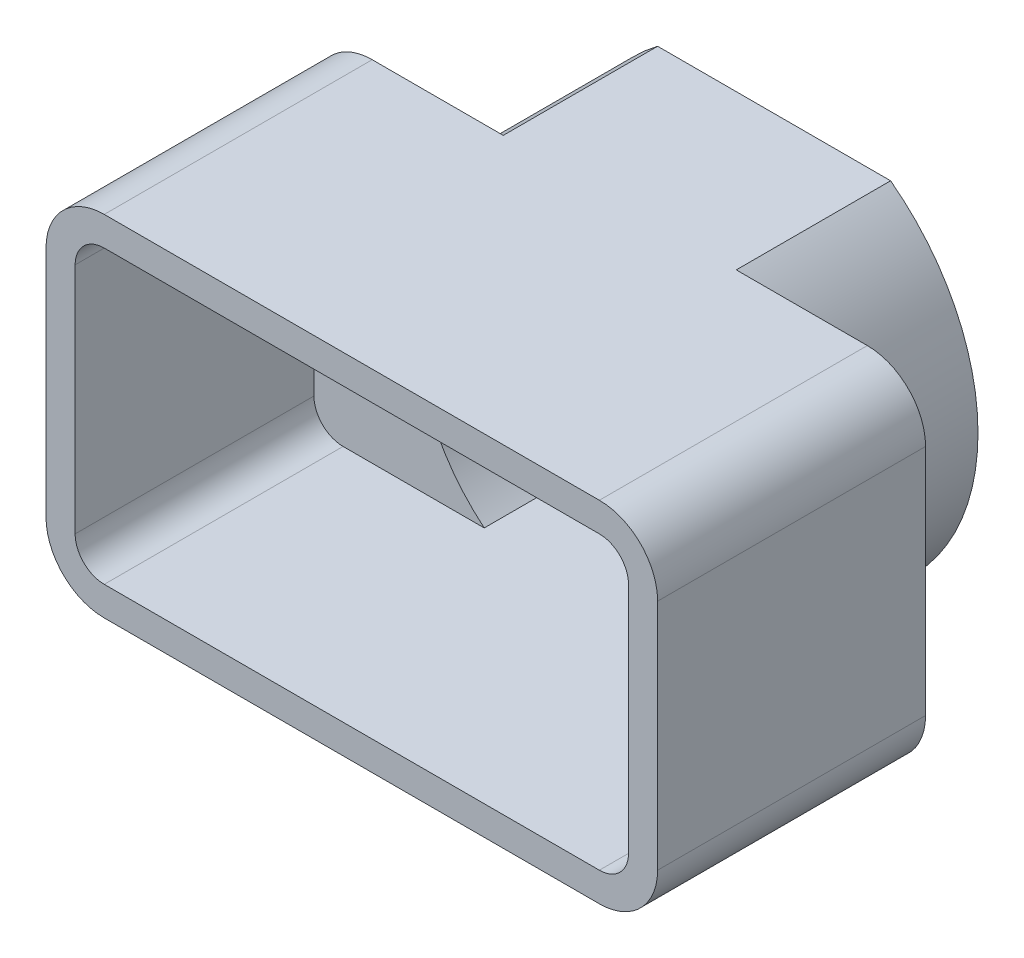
ISO-10303-21;
HEADER;
FILE_DESCRIPTION(('STEP AP214'),'2;1');
FILE_NAME('part.step','',(''),(''),'','','');
FILE_SCHEMA(('AUTOMOTIVE_DESIGN { 1 0 10303 214 1 1 1 1 }'));
ENDSEC;
DATA;
#1=APPLICATION_CONTEXT('core data for automotive mechanical design processes');
#2=APPLICATION_PROTOCOL_DEFINITION('international standard','automotive_design',2000,#1);
#3=PRODUCT_CONTEXT('',#1,'mechanical');
#4=PRODUCT('Part','Part','',(#3));
#5=PRODUCT_RELATED_PRODUCT_CATEGORY('part','',(#4));
#6=PRODUCT_DEFINITION_FORMATION('','',#4);
#7=PRODUCT_DEFINITION_CONTEXT('part definition',#1,'design');
#8=PRODUCT_DEFINITION('design','',#6,#7);
#9=PRODUCT_DEFINITION_SHAPE('','',#8);
#10=(LENGTH_UNIT() NAMED_UNIT(*) SI_UNIT(.MILLI.,.METRE.));
#11=(NAMED_UNIT(*) PLANE_ANGLE_UNIT() SI_UNIT($,.RADIAN.));
#12=(NAMED_UNIT(*) SI_UNIT($,.STERADIAN.) SOLID_ANGLE_UNIT());
#13=UNCERTAINTY_MEASURE_WITH_UNIT(LENGTH_MEASURE(1.E-05),#10,'distance_accuracy_value','');
#14=(GEOMETRIC_REPRESENTATION_CONTEXT(3) GLOBAL_UNCERTAINTY_ASSIGNED_CONTEXT((#13)) GLOBAL_UNIT_ASSIGNED_CONTEXT((#10,
#11,#12)) REPRESENTATION_CONTEXT('',''));
#15=CARTESIAN_POINT('',(0.,0.,0.));
#16=DIRECTION('',(0.,0.,1.));
#17=DIRECTION('',(1.,0.,0.));
#18=AXIS2_PLACEMENT_3D('',#15,#16,#17);
#19=CARTESIAN_POINT('',(-0.5,0.,5.3));
#20=DIRECTION('',(0.,0.,-1.));
#21=DIRECTION('',(-1.,0.,0.));
#22=AXIS2_PLACEMENT_3D('',#19,#20,#21);
#23=CYLINDRICAL_SURFACE('',#22,6.5);
#24=DIRECTION('',(0.,0.,-1.));
#25=VECTOR('',#24,1.);
#26=CARTESIAN_POINT('',(3.65331193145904,5.,5.3));
#27=LINE('',#26,#25);
#28=CARTESIAN_POINT('',(3.65331193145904,5.,6.3));
#29=VERTEX_POINT('',#28);
#30=CARTESIAN_POINT('',(3.65331193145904,5.,1.));
#31=VERTEX_POINT('',#30);
#32=EDGE_CURVE('E204',#29,#31,#27,.T.);
#33=ORIENTED_EDGE('',*,*,#32,.T.);
#34=CARTESIAN_POINT('',(-0.5,0.,1.));
#35=DIRECTION('',(0.,0.,-1.));
#36=DIRECTION('',(-1.,0.,0.));
#37=AXIS2_PLACEMENT_3D('',#34,#35,#36);
#38=CIRCLE('',#37,6.5);
#39=CARTESIAN_POINT('',(3.65331193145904,-5.,1.));
#40=VERTEX_POINT('',#39);
#41=EDGE_CURVE('E192',#31,#40,#38,.T.);
#42=ORIENTED_EDGE('',*,*,#41,.T.);
#43=DIRECTION('',(0.,0.,-1.));
#44=VECTOR('',#43,1.);
#45=CARTESIAN_POINT('',(3.65331193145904,-5.,5.3));
#46=LINE('',#45,#44);
#47=CARTESIAN_POINT('',(3.65331193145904,-5.,6.3));
#48=VERTEX_POINT('',#47);
#49=EDGE_CURVE('E202',#48,#40,#46,.T.);
#50=ORIENTED_EDGE('',*,*,#49,.F.);
#51=CARTESIAN_POINT('',(-0.5,0.,6.3));
#52=DIRECTION('',(0.,0.,-1.));
#53=DIRECTION('',(-1.,0.,0.));
#54=AXIS2_PLACEMENT_3D('',#51,#52,#53);
#55=CIRCLE('',#54,6.5);
#56=EDGE_CURVE('E377',#29,#48,#55,.T.);
#57=ORIENTED_EDGE('',*,*,#56,.F.);
#58=EDGE_LOOP('',(#33,#42,#50,#57));
#59=FACE_BOUND('',#58,.T.);
#60=ADVANCED_FACE('F31',(#59),#23,.F.);
#61=CARTESIAN_POINT('',(3.65331193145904,5.,5.3));
#62=DIRECTION('',(0.,-1.,0.));
#63=DIRECTION('',(0.,0.,-1.));
#64=AXIS2_PLACEMENT_3D('',#61,#62,#63);
#65=PLANE('',#64);
#66=DIRECTION('',(0.,0.,-1.));
#67=VECTOR('',#66,1.);
#68=CARTESIAN_POINT('',(-3.65331193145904,5.,5.3));
#69=LINE('',#68,#67);
#70=CARTESIAN_POINT('',(-3.65331193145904,5.,6.3));
#71=VERTEX_POINT('',#70);
#72=CARTESIAN_POINT('',(-3.65331193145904,5.,1.));
#73=VERTEX_POINT('',#72);
#74=EDGE_CURVE('E215',#71,#73,#69,.T.);
#75=ORIENTED_EDGE('',*,*,#74,.T.);
#76=DIRECTION('',(1.,0.,0.));
#77=VECTOR('',#76,1.);
#78=CARTESIAN_POINT('',(3.65331193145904,5.,1.));
#79=LINE('',#78,#77);
#80=EDGE_CURVE('E206',#73,#31,#79,.T.);
#81=ORIENTED_EDGE('',*,*,#80,.T.);
#82=ORIENTED_EDGE('',*,*,#32,.F.);
#83=DIRECTION('',(-1.,0.,0.));
#84=VECTOR('',#83,1.);
#85=CARTESIAN_POINT('',(-8.49999999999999,5.,6.3));
#86=LINE('',#85,#84);
#87=CARTESIAN_POINT('',(8.49999999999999,5.,6.3));
#88=VERTEX_POINT('',#87);
#89=EDGE_CURVE('E656',#88,#29,#86,.T.);
#90=ORIENTED_EDGE('',*,*,#89,.F.);
#91=DIRECTION('',(0.,0.,1.));
#92=VECTOR('',#91,1.);
#93=CARTESIAN_POINT('',(8.49999999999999,5.,6.3));
#94=LINE('',#93,#92);
#95=CARTESIAN_POINT('',(8.49999999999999,5.,14.5));
#96=VERTEX_POINT('',#95);
#97=EDGE_CURVE('E675',#88,#96,#94,.T.);
#98=ORIENTED_EDGE('',*,*,#97,.T.);
#99=DIRECTION('',(-1.,0.,0.));
#100=VECTOR('',#99,1.);
#101=CARTESIAN_POINT('',(-3.65331193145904,5.,14.5));
#102=LINE('',#101,#100);
#103=CARTESIAN_POINT('',(-8.49999999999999,5.,14.5));
#104=VERTEX_POINT('',#103);
#105=EDGE_CURVE('E53',#96,#104,#102,.T.);
#106=ORIENTED_EDGE('',*,*,#105,.T.);
#107=DIRECTION('',(0.,0.,1.));
#108=VECTOR('',#107,1.);
#109=CARTESIAN_POINT('',(-8.49999999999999,5.,6.3));
#110=LINE('',#109,#108);
#111=CARTESIAN_POINT('',(-8.49999999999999,5.,6.3));
#112=VERTEX_POINT('',#111);
#113=EDGE_CURVE('E706',#112,#104,#110,.T.);
#114=ORIENTED_EDGE('',*,*,#113,.F.);
#115=EDGE_CURVE('E654',#71,#112,#86,.T.);
#116=ORIENTED_EDGE('',*,*,#115,.F.);
#117=EDGE_LOOP('',(#75,#81,#82,#90,#98,#106,#114,#116));
#118=FACE_BOUND('',#117,.T.);
#119=ADVANCED_FACE('F398',(#118),#65,.T.);
#120=CARTESIAN_POINT('',(0.5,0.,5.3));
#121=DIRECTION('',(0.,0.,-1.));
#122=DIRECTION('',(-1.,0.,0.));
#123=AXIS2_PLACEMENT_3D('',#120,#121,#122);
#124=CYLINDRICAL_SURFACE('',#123,6.5);
#125=DIRECTION('',(0.,0.,-1.));
#126=VECTOR('',#125,1.);
#127=CARTESIAN_POINT('',(-3.65331193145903,-5.,5.3));
#128=LINE('',#127,#126);
#129=CARTESIAN_POINT('',(-3.65331193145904,-5.,6.3));
#130=VERTEX_POINT('',#129);
#131=CARTESIAN_POINT('',(-3.65331193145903,-5.,1.));
#132=VERTEX_POINT('',#131);
#133=EDGE_CURVE('E212',#130,#132,#128,.T.);
#134=ORIENTED_EDGE('',*,*,#133,.T.);
#135=CARTESIAN_POINT('',(0.5,0.,1.));
#136=DIRECTION('',(0.,0.,-1.));
#137=DIRECTION('',(-1.,0.,0.));
#138=AXIS2_PLACEMENT_3D('',#135,#136,#137);
#139=CIRCLE('',#138,6.5);
#140=EDGE_CURVE('E46',#132,#73,#139,.T.);
#141=ORIENTED_EDGE('',*,*,#140,.T.);
#142=ORIENTED_EDGE('',*,*,#74,.F.);
#143=CARTESIAN_POINT('',(0.5,0.,6.3));
#144=DIRECTION('',(0.,0.,-1.));
#145=DIRECTION('',(-1.,0.,0.));
#146=AXIS2_PLACEMENT_3D('',#143,#144,#145);
#147=CIRCLE('',#146,6.5);
#148=EDGE_CURVE('E693',#130,#71,#147,.T.);
#149=ORIENTED_EDGE('',*,*,#148,.F.);
#150=EDGE_LOOP('',(#134,#141,#142,#149));
#151=FACE_BOUND('',#150,.T.);
#152=ADVANCED_FACE('F403',(#151),#124,.F.);
#153=CARTESIAN_POINT('',(3.65331193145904,-5.,5.3));
#154=DIRECTION('',(0.,1.,0.));
#155=DIRECTION('',(0.,0.,1.));
#156=AXIS2_PLACEMENT_3D('',#153,#154,#155);
#157=PLANE('',#156);
#158=ORIENTED_EDGE('',*,*,#49,.T.);
#159=DIRECTION('',(-1.,0.,0.));
#160=VECTOR('',#159,1.);
#161=CARTESIAN_POINT('',(3.65331193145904,-5.,1.));
#162=LINE('',#161,#160);
#163=EDGE_CURVE('E11',#40,#132,#162,.T.);
#164=ORIENTED_EDGE('',*,*,#163,.T.);
#165=ORIENTED_EDGE('',*,*,#133,.F.);
#166=DIRECTION('',(1.,0.,0.));
#167=VECTOR('',#166,1.);
#168=CARTESIAN_POINT('',(-8.49999999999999,-5.,6.3));
#169=LINE('',#168,#167);
#170=CARTESIAN_POINT('',(-8.49999999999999,-5.,6.3));
#171=VERTEX_POINT('',#170);
#172=EDGE_CURVE('E667',#171,#130,#169,.T.);
#173=ORIENTED_EDGE('',*,*,#172,.F.);
#174=DIRECTION('',(0.,0.,1.));
#175=VECTOR('',#174,1.);
#176=CARTESIAN_POINT('',(-8.49999999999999,-5.,6.3));
#177=LINE('',#176,#175);
#178=CARTESIAN_POINT('',(-8.49999999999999,-5.,14.5));
#179=VERTEX_POINT('',#178);
#180=EDGE_CURVE('E699',#171,#179,#177,.T.);
#181=ORIENTED_EDGE('',*,*,#180,.T.);
#182=DIRECTION('',(1.,0.,0.));
#183=VECTOR('',#182,1.);
#184=CARTESIAN_POINT('',(-3.65331193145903,-5.,14.5));
#185=LINE('',#184,#183);
#186=CARTESIAN_POINT('',(8.49999999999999,-5.,14.5));
#187=VERTEX_POINT('',#186);
#188=EDGE_CURVE('E371',#179,#187,#185,.T.);
#189=ORIENTED_EDGE('',*,*,#188,.T.);
#190=DIRECTION('',(0.,0.,1.));
#191=VECTOR('',#190,1.);
#192=CARTESIAN_POINT('',(8.49999999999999,-5.,6.3));
#193=LINE('',#192,#191);
#194=CARTESIAN_POINT('',(8.49999999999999,-5.,6.3));
#195=VERTEX_POINT('',#194);
#196=EDGE_CURVE('E696',#195,#187,#193,.T.);
#197=ORIENTED_EDGE('',*,*,#196,.F.);
#198=EDGE_CURVE('E211',#48,#195,#169,.T.);
#199=ORIENTED_EDGE('',*,*,#198,.F.);
#200=EDGE_LOOP('',(#158,#164,#165,#173,#181,#189,#197,#199));
#201=FACE_BOUND('',#200,.T.);
#202=ADVANCED_FACE('F209',(#201),#157,.T.);
#203=CARTESIAN_POINT('',(-0.5,0.,0.));
#204=DIRECTION('',(0.,0.,-1.));
#205=DIRECTION('',(-1.,0.,0.));
#206=AXIS2_PLACEMENT_3D('',#203,#204,#205);
#207=PLANE('',#206);
#208=CARTESIAN_POINT('',(-0.5,0.,0.));
#209=DIRECTION('',(0.,0.,1.));
#210=DIRECTION('',(-1.,0.,0.));
#211=AXIS2_PLACEMENT_3D('',#208,#209,#210);
#212=CIRCLE('',#211,7.5);
#213=CARTESIAN_POINT('',(4.,-6.,0.));
#214=VERTEX_POINT('',#213);
#215=CARTESIAN_POINT('',(4.,6.,0.));
#216=VERTEX_POINT('',#215);
#217=EDGE_CURVE('E228',#214,#216,#212,.T.);
#218=ORIENTED_EDGE('',*,*,#217,.F.);
#219=DIRECTION('',(1.,0.,0.));
#220=VECTOR('',#219,1.);
#221=CARTESIAN_POINT('',(4.,-6.,0.));
#222=LINE('',#221,#220);
#223=CARTESIAN_POINT('',(-4.,-6.,0.));
#224=VERTEX_POINT('',#223);
#225=EDGE_CURVE('E239',#224,#214,#222,.T.);
#226=ORIENTED_EDGE('',*,*,#225,.F.);
#227=CARTESIAN_POINT('',(0.5,0.,0.));
#228=DIRECTION('',(0.,0.,1.));
#229=DIRECTION('',(1.,0.,0.));
#230=AXIS2_PLACEMENT_3D('',#227,#228,#229);
#231=CIRCLE('',#230,7.5);
#232=CARTESIAN_POINT('',(-4.,6.,0.));
#233=VERTEX_POINT('',#232);
#234=EDGE_CURVE('E268',#233,#224,#231,.T.);
#235=ORIENTED_EDGE('',*,*,#234,.F.);
#236=DIRECTION('',(-1.,0.,0.));
#237=VECTOR('',#236,1.);
#238=CARTESIAN_POINT('',(4.,6.,0.));
#239=LINE('',#238,#237);
#240=EDGE_CURVE('E272',#216,#233,#239,.T.);
#241=ORIENTED_EDGE('',*,*,#240,.F.);
#242=EDGE_LOOP('',(#218,#226,#235,#241));
#243=FACE_BOUND('',#242,.T.);
#244=CARTESIAN_POINT('',(0.,0.,0.));
#245=DIRECTION('',(0.,0.,-1.));
#246=DIRECTION('',(-1.,0.,0.));
#247=AXIS2_PLACEMENT_3D('',#244,#245,#246);
#248=CIRCLE('',#247,1.);
#249=CARTESIAN_POINT('',(-1.,0.,0.));
#250=VERTEX_POINT('',#249);
#251=EDGE_CURVE('E645',#250,#250,#248,.T.);
#252=ORIENTED_EDGE('',*,*,#251,.F.);
#253=EDGE_LOOP('',(#252));
#254=FACE_BOUND('',#253,.T.);
#255=ADVANCED_FACE('F278',(#243,#254),#207,.T.);
#256=CARTESIAN_POINT('',(-0.5,0.,5.3));
#257=DIRECTION('',(0.,0.,-1.));
#258=DIRECTION('',(-1.,0.,0.));
#259=AXIS2_PLACEMENT_3D('',#256,#257,#258);
#260=CYLINDRICAL_SURFACE('',#259,7.5);
#261=ORIENTED_EDGE('',*,*,#217,.T.);
#262=DIRECTION('',(0.,0.,-1.));
#263=VECTOR('',#262,1.);
#264=CARTESIAN_POINT('',(4.,6.,5.3));
#265=LINE('',#264,#263);
#266=CARTESIAN_POINT('',(4.,6.,5.3));
#267=VERTEX_POINT('',#266);
#268=EDGE_CURVE('E39',#267,#216,#265,.T.);
#269=ORIENTED_EDGE('',*,*,#268,.F.);
#270=CARTESIAN_POINT('',(-0.5,0.,5.3));
#271=DIRECTION('',(0.,0.,1.));
#272=DIRECTION('',(-1.,0.,0.));
#273=AXIS2_PLACEMENT_3D('',#270,#271,#272);
#274=CIRCLE('',#273,7.5);
#275=CARTESIAN_POINT('',(4.,-6.,5.3));
#276=VERTEX_POINT('',#275);
#277=EDGE_CURVE('E234',#276,#267,#274,.T.);
#278=ORIENTED_EDGE('',*,*,#277,.F.);
#279=DIRECTION('',(0.,0.,-1.));
#280=VECTOR('',#279,1.);
#281=CARTESIAN_POINT('',(4.,-6.,5.3));
#282=LINE('',#281,#280);
#283=EDGE_CURVE('E246',#276,#214,#282,.T.);
#284=ORIENTED_EDGE('',*,*,#283,.T.);
#285=EDGE_LOOP('',(#261,#269,#278,#284));
#286=FACE_BOUND('',#285,.T.);
#287=ADVANCED_FACE('F33',(#286),#260,.T.);
#288=CARTESIAN_POINT('',(4.,6.,5.3));
#289=DIRECTION('',(0.,-1.,0.));
#290=DIRECTION('',(1.,0.,0.));
#291=AXIS2_PLACEMENT_3D('',#288,#289,#290);
#292=PLANE('',#291);
#293=ORIENTED_EDGE('',*,*,#240,.T.);
#294=DIRECTION('',(0.,0.,-1.));
#295=VECTOR('',#294,1.);
#296=CARTESIAN_POINT('',(-4.,6.,5.3));
#297=LINE('',#296,#295);
#298=CARTESIAN_POINT('',(-4.,6.,5.3));
#299=VERTEX_POINT('',#298);
#300=EDGE_CURVE('E243',#299,#233,#297,.T.);
#301=ORIENTED_EDGE('',*,*,#300,.F.);
#302=DIRECTION('',(-1.,0.,0.));
#303=VECTOR('',#302,1.);
#304=CARTESIAN_POINT('',(-8.49999999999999,6.,5.3));
#305=LINE('',#304,#303);
#306=CARTESIAN_POINT('',(-8.49999999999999,6.,5.3));
#307=VERTEX_POINT('',#306);
#308=EDGE_CURVE('E294',#299,#307,#305,.T.);
#309=ORIENTED_EDGE('',*,*,#308,.T.);
#310=DIRECTION('',(0.,0.,-1.));
#311=VECTOR('',#310,1.);
#312=CARTESIAN_POINT('',(-8.49999999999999,6.,14.5));
#313=LINE('',#312,#311);
#314=CARTESIAN_POINT('',(-8.49999999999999,6.,14.5));
#315=VERTEX_POINT('',#314);
#316=EDGE_CURVE('E307',#315,#307,#313,.T.);
#317=ORIENTED_EDGE('',*,*,#316,.F.);
#318=DIRECTION('',(-1.,0.,0.));
#319=VECTOR('',#318,1.);
#320=CARTESIAN_POINT('',(-8.49999999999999,6.,14.5));
#321=LINE('',#320,#319);
#322=CARTESIAN_POINT('',(8.49999999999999,6.,14.5));
#323=VERTEX_POINT('',#322);
#324=EDGE_CURVE('E311',#323,#315,#321,.T.);
#325=ORIENTED_EDGE('',*,*,#324,.F.);
#326=DIRECTION('',(0.,0.,-1.));
#327=VECTOR('',#326,1.);
#328=CARTESIAN_POINT('',(8.49999999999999,6.,14.5));
#329=LINE('',#328,#327);
#330=CARTESIAN_POINT('',(8.49999999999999,6.,5.3));
#331=VERTEX_POINT('',#330);
#332=EDGE_CURVE('E292',#323,#331,#329,.T.);
#333=ORIENTED_EDGE('',*,*,#332,.T.);
#334=EDGE_CURVE('E287',#331,#267,#305,.T.);
#335=ORIENTED_EDGE('',*,*,#334,.T.);
#336=ORIENTED_EDGE('',*,*,#268,.T.);
#337=EDGE_LOOP('',(#293,#301,#309,#317,#325,#333,#335,#336));
#338=FACE_BOUND('',#337,.T.);
#339=ADVANCED_FACE('F273',(#338),#292,.F.);
#340=CARTESIAN_POINT('',(0.5,0.,5.3));
#341=DIRECTION('',(0.,0.,-1.));
#342=DIRECTION('',(-1.,0.,0.));
#343=AXIS2_PLACEMENT_3D('',#340,#341,#342);
#344=CYLINDRICAL_SURFACE('',#343,7.5);
#345=ORIENTED_EDGE('',*,*,#234,.T.);
#346=DIRECTION('',(0.,0.,-1.));
#347=VECTOR('',#346,1.);
#348=CARTESIAN_POINT('',(-4.,-6.,5.3));
#349=LINE('',#348,#347);
#350=CARTESIAN_POINT('',(-4.,-6.,5.3));
#351=VERTEX_POINT('',#350);
#352=EDGE_CURVE('E247',#351,#224,#349,.T.);
#353=ORIENTED_EDGE('',*,*,#352,.F.);
#354=CARTESIAN_POINT('',(0.5,0.,5.3));
#355=DIRECTION('',(0.,0.,1.));
#356=DIRECTION('',(1.,0.,0.));
#357=AXIS2_PLACEMENT_3D('',#354,#355,#356);
#358=CIRCLE('',#357,7.5);
#359=EDGE_CURVE('E238',#299,#351,#358,.T.);
#360=ORIENTED_EDGE('',*,*,#359,.F.);
#361=ORIENTED_EDGE('',*,*,#300,.T.);
#362=EDGE_LOOP('',(#345,#353,#360,#361));
#363=FACE_BOUND('',#362,.T.);
#364=ADVANCED_FACE('F266',(#363),#344,.T.);
#365=CARTESIAN_POINT('',(4.,-6.,5.3));
#366=DIRECTION('',(0.,1.,0.));
#367=DIRECTION('',(-1.,0.,0.));
#368=AXIS2_PLACEMENT_3D('',#365,#366,#367);
#369=PLANE('',#368);
#370=ORIENTED_EDGE('',*,*,#225,.T.);
#371=ORIENTED_EDGE('',*,*,#283,.F.);
#372=DIRECTION('',(1.,0.,0.));
#373=VECTOR('',#372,1.);
#374=CARTESIAN_POINT('',(-8.49999999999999,-6.,5.3));
#375=LINE('',#374,#373);
#376=CARTESIAN_POINT('',(8.49999999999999,-6.,5.3));
#377=VERTEX_POINT('',#376);
#378=EDGE_CURVE('E221',#276,#377,#375,.T.);
#379=ORIENTED_EDGE('',*,*,#378,.T.);
#380=DIRECTION('',(0.,0.,-1.));
#381=VECTOR('',#380,1.);
#382=CARTESIAN_POINT('',(8.49999999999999,-6.,14.5));
#383=LINE('',#382,#381);
#384=CARTESIAN_POINT('',(8.49999999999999,-6.,14.5));
#385=VERTEX_POINT('',#384);
#386=EDGE_CURVE('E319',#385,#377,#383,.T.);
#387=ORIENTED_EDGE('',*,*,#386,.F.);
#388=DIRECTION('',(1.,0.,0.));
#389=VECTOR('',#388,1.);
#390=CARTESIAN_POINT('',(-8.49999999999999,-6.,14.5));
#391=LINE('',#390,#389);
#392=CARTESIAN_POINT('',(-8.49999999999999,-6.,14.5));
#393=VERTEX_POINT('',#392);
#394=EDGE_CURVE('E364',#393,#385,#391,.T.);
#395=ORIENTED_EDGE('',*,*,#394,.F.);
#396=DIRECTION('',(0.,0.,-1.));
#397=VECTOR('',#396,1.);
#398=CARTESIAN_POINT('',(-8.49999999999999,-6.,14.5));
#399=LINE('',#398,#397);
#400=CARTESIAN_POINT('',(-8.49999999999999,-6.,5.3));
#401=VERTEX_POINT('',#400);
#402=EDGE_CURVE('E322',#393,#401,#399,.T.);
#403=ORIENTED_EDGE('',*,*,#402,.T.);
#404=EDGE_CURVE('E337',#401,#351,#375,.T.);
#405=ORIENTED_EDGE('',*,*,#404,.T.);
#406=ORIENTED_EDGE('',*,*,#352,.T.);
#407=EDGE_LOOP('',(#370,#371,#379,#387,#395,#403,#405,#406));
#408=FACE_BOUND('',#407,.T.);
#409=ADVANCED_FACE('F386',(#408),#369,.F.);
#410=CARTESIAN_POINT('',(-8.5,4.,5.3));
#411=DIRECTION('',(0.,0.,-1.));
#412=DIRECTION('',(-1.,0.,0.));
#413=AXIS2_PLACEMENT_3D('',#410,#411,#412);
#414=PLANE('',#413);
#415=ORIENTED_EDGE('',*,*,#378,.F.);
#416=ORIENTED_EDGE('',*,*,#277,.T.);
#417=ORIENTED_EDGE('',*,*,#334,.F.);
#418=CARTESIAN_POINT('',(8.5,4.,5.3));
#419=DIRECTION('',(0.,0.,1.));
#420=DIRECTION('',(-1.,0.,0.));
#421=AXIS2_PLACEMENT_3D('',#418,#419,#420);
#422=CIRCLE('',#421,2.);
#423=CARTESIAN_POINT('',(10.5,3.99999999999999,5.3));
#424=VERTEX_POINT('',#423);
#425=EDGE_CURVE('E299',#424,#331,#422,.T.);
#426=ORIENTED_EDGE('',*,*,#425,.F.);
#427=DIRECTION('',(0.,1.,0.));
#428=VECTOR('',#427,1.);
#429=CARTESIAN_POINT('',(10.5,-3.99999999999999,5.3));
#430=LINE('',#429,#428);
#431=CARTESIAN_POINT('',(10.5,-3.99999999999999,5.3));
#432=VERTEX_POINT('',#431);
#433=EDGE_CURVE('E347',#432,#424,#430,.T.);
#434=ORIENTED_EDGE('',*,*,#433,.F.);
#435=CARTESIAN_POINT('',(8.5,-4.,5.3));
#436=DIRECTION('',(0.,0.,1.));
#437=DIRECTION('',(1.,0.,0.));
#438=AXIS2_PLACEMENT_3D('',#435,#436,#437);
#439=CIRCLE('',#438,2.);
#440=EDGE_CURVE('E344',#377,#432,#439,.T.);
#441=ORIENTED_EDGE('',*,*,#440,.F.);
#442=EDGE_LOOP('',(#415,#416,#417,#426,#434,#441));
#443=FACE_BOUND('',#442,.T.);
#444=ADVANCED_FACE('F285',(#443),#414,.T.);
#445=CARTESIAN_POINT('',(-8.5,4.,14.5));
#446=DIRECTION('',(0.,0.,-1.));
#447=DIRECTION('',(-1.,0.,0.));
#448=AXIS2_PLACEMENT_3D('',#445,#446,#447);
#449=PLANE('',#448);
#450=CARTESIAN_POINT('',(-8.5,4.,14.5));
#451=DIRECTION('',(0.,0.,1.));
#452=DIRECTION('',(-1.,0.,0.));
#453=AXIS2_PLACEMENT_3D('',#450,#451,#452);
#454=CIRCLE('',#453,2.);
#455=CARTESIAN_POINT('',(-10.5,3.99999999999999,14.5));
#456=VERTEX_POINT('',#455);
#457=EDGE_CURVE('E293',#315,#456,#454,.T.);
#458=ORIENTED_EDGE('',*,*,#457,.T.);
#459=DIRECTION('',(0.,-1.,0.));
#460=VECTOR('',#459,1.);
#461=CARTESIAN_POINT('',(-10.5,-3.99999999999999,14.5));
#462=LINE('',#461,#460);
#463=CARTESIAN_POINT('',(-10.5,-3.99999999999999,14.5));
#464=VERTEX_POINT('',#463);
#465=EDGE_CURVE('E297',#456,#464,#462,.T.);
#466=ORIENTED_EDGE('',*,*,#465,.T.);
#467=CARTESIAN_POINT('',(-8.5,-4.,14.5));
#468=DIRECTION('',(0.,0.,1.));
#469=DIRECTION('',(-1.,0.,0.));
#470=AXIS2_PLACEMENT_3D('',#467,#468,#469);
#471=CIRCLE('',#470,2.);
#472=EDGE_CURVE('E332',#464,#393,#471,.T.);
#473=ORIENTED_EDGE('',*,*,#472,.T.);
#474=ORIENTED_EDGE('',*,*,#394,.T.);
#475=CARTESIAN_POINT('',(8.5,-4.,14.5));
#476=DIRECTION('',(0.,0.,1.));
#477=DIRECTION('',(1.,0.,0.));
#478=AXIS2_PLACEMENT_3D('',#475,#476,#477);
#479=CIRCLE('',#478,2.);
#480=CARTESIAN_POINT('',(10.5,-3.99999999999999,14.5));
#481=VERTEX_POINT('',#480);
#482=EDGE_CURVE('E361',#385,#481,#479,.T.);
#483=ORIENTED_EDGE('',*,*,#482,.T.);
#484=DIRECTION('',(0.,1.,0.));
#485=VECTOR('',#484,1.);
#486=CARTESIAN_POINT('',(10.5,-3.99999999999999,14.5));
#487=LINE('',#486,#485);
#488=CARTESIAN_POINT('',(10.5,3.99999999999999,14.5));
#489=VERTEX_POINT('',#488);
#490=EDGE_CURVE('E359',#481,#489,#487,.T.);
#491=ORIENTED_EDGE('',*,*,#490,.T.);
#492=CARTESIAN_POINT('',(8.5,4.,14.5));
#493=DIRECTION('',(0.,0.,1.));
#494=DIRECTION('',(-1.,0.,0.));
#495=AXIS2_PLACEMENT_3D('',#492,#493,#494);
#496=CIRCLE('',#495,2.);
#497=EDGE_CURVE('E356',#489,#323,#496,.T.);
#498=ORIENTED_EDGE('',*,*,#497,.T.);
#499=ORIENTED_EDGE('',*,*,#324,.T.);
#500=EDGE_LOOP('',(#458,#466,#473,#474,#483,#491,#498,#499));
#501=FACE_BOUND('',#500,.T.);
#502=ORIENTED_EDGE('',*,*,#188,.F.);
#503=CARTESIAN_POINT('',(-8.5,-4.,14.5));
#504=DIRECTION('',(0.,0.,1.));
#505=DIRECTION('',(-1.,0.,0.));
#506=AXIS2_PLACEMENT_3D('',#503,#504,#505);
#507=CIRCLE('',#506,1.);
#508=CARTESIAN_POINT('',(-9.5,-3.99999999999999,14.5));
#509=VERTEX_POINT('',#508);
#510=EDGE_CURVE('E683',#509,#179,#507,.T.);
#511=ORIENTED_EDGE('',*,*,#510,.F.);
#512=DIRECTION('',(0.,-1.,0.));
#513=VECTOR('',#512,1.);
#514=CARTESIAN_POINT('',(-9.5,-3.99999999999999,14.5));
#515=LINE('',#514,#513);
#516=CARTESIAN_POINT('',(-9.5,3.99999999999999,14.5));
#517=VERTEX_POINT('',#516);
#518=EDGE_CURVE('E680',#517,#509,#515,.T.);
#519=ORIENTED_EDGE('',*,*,#518,.F.);
#520=CARTESIAN_POINT('',(-8.5,4.,14.5));
#521=DIRECTION('',(0.,0.,1.));
#522=DIRECTION('',(-1.,0.,0.));
#523=AXIS2_PLACEMENT_3D('',#520,#521,#522);
#524=CIRCLE('',#523,1.);
#525=EDGE_CURVE('E677',#104,#517,#524,.T.);
#526=ORIENTED_EDGE('',*,*,#525,.F.);
#527=ORIENTED_EDGE('',*,*,#105,.F.);
#528=CARTESIAN_POINT('',(8.5,4.,14.5));
#529=DIRECTION('',(0.,0.,1.));
#530=DIRECTION('',(-1.,0.,0.));
#531=AXIS2_PLACEMENT_3D('',#528,#529,#530);
#532=CIRCLE('',#531,1.);
#533=CARTESIAN_POINT('',(9.5,3.99999999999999,14.5));
#534=VERTEX_POINT('',#533);
#535=EDGE_CURVE('E205',#534,#96,#532,.T.);
#536=ORIENTED_EDGE('',*,*,#535,.F.);
#537=DIRECTION('',(0.,1.,0.));
#538=VECTOR('',#537,1.);
#539=CARTESIAN_POINT('',(9.5,-3.99999999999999,14.5));
#540=LINE('',#539,#538);
#541=CARTESIAN_POINT('',(9.5,-3.99999999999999,14.5));
#542=VERTEX_POINT('',#541);
#543=EDGE_CURVE('E655',#542,#534,#540,.T.);
#544=ORIENTED_EDGE('',*,*,#543,.F.);
#545=CARTESIAN_POINT('',(8.5,-4.,14.5));
#546=DIRECTION('',(0.,0.,1.));
#547=DIRECTION('',(1.,0.,0.));
#548=AXIS2_PLACEMENT_3D('',#545,#546,#547);
#549=CIRCLE('',#548,1.);
#550=EDGE_CURVE('E686',#187,#542,#549,.T.);
#551=ORIENTED_EDGE('',*,*,#550,.F.);
#552=EDGE_LOOP('',(#502,#511,#519,#526,#527,#536,#544,#551));
#553=FACE_BOUND('',#552,.T.);
#554=ADVANCED_FACE('F384',(#501,#553),#449,.F.);
#555=ORIENTED_EDGE('',*,*,#308,.F.);
#556=ORIENTED_EDGE('',*,*,#359,.T.);
#557=ORIENTED_EDGE('',*,*,#404,.F.);
#558=CARTESIAN_POINT('',(-8.5,-4.,5.3));
#559=DIRECTION('',(0.,0.,1.));
#560=DIRECTION('',(-1.,0.,0.));
#561=AXIS2_PLACEMENT_3D('',#558,#559,#560);
#562=CIRCLE('',#561,2.);
#563=CARTESIAN_POINT('',(-10.5,-3.99999999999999,5.3));
#564=VERTEX_POINT('',#563);
#565=EDGE_CURVE('E331',#564,#401,#562,.T.);
#566=ORIENTED_EDGE('',*,*,#565,.F.);
#567=DIRECTION('',(0.,-1.,0.));
#568=VECTOR('',#567,1.);
#569=CARTESIAN_POINT('',(-10.5,-3.99999999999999,5.3));
#570=LINE('',#569,#568);
#571=CARTESIAN_POINT('',(-10.5,3.99999999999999,5.3));
#572=VERTEX_POINT('',#571);
#573=EDGE_CURVE('E336',#572,#564,#570,.T.);
#574=ORIENTED_EDGE('',*,*,#573,.F.);
#575=CARTESIAN_POINT('',(-8.5,4.,5.3));
#576=DIRECTION('',(0.,0.,1.));
#577=DIRECTION('',(-1.,0.,0.));
#578=AXIS2_PLACEMENT_3D('',#575,#576,#577);
#579=CIRCLE('',#578,2.);
#580=EDGE_CURVE('E339',#307,#572,#579,.T.);
#581=ORIENTED_EDGE('',*,*,#580,.F.);
#582=EDGE_LOOP('',(#555,#556,#557,#566,#574,#581));
#583=FACE_BOUND('',#582,.T.);
#584=ADVANCED_FACE('F334',(#583),#414,.T.);
#585=CARTESIAN_POINT('',(-8.5,4.,14.5));
#586=DIRECTION('',(0.,0.,-1.));
#587=DIRECTION('',(-1.,0.,0.));
#588=AXIS2_PLACEMENT_3D('',#585,#586,#587);
#589=CYLINDRICAL_SURFACE('',#588,2.);
#590=ORIENTED_EDGE('',*,*,#580,.T.);
#591=DIRECTION('',(0.,0.,-1.));
#592=VECTOR('',#591,1.);
#593=CARTESIAN_POINT('',(-10.5,3.99999999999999,14.5));
#594=LINE('',#593,#592);
#595=EDGE_CURVE('E213',#456,#572,#594,.T.);
#596=ORIENTED_EDGE('',*,*,#595,.F.);
#597=ORIENTED_EDGE('',*,*,#457,.F.);
#598=ORIENTED_EDGE('',*,*,#316,.T.);
#599=EDGE_LOOP('',(#590,#596,#597,#598));
#600=FACE_BOUND('',#599,.T.);
#601=ADVANCED_FACE('F570',(#600),#589,.T.);
#602=CARTESIAN_POINT('',(-10.5,-3.99999999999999,14.5));
#603=DIRECTION('',(1.,0.,0.));
#604=DIRECTION('',(0.,0.,-1.));
#605=AXIS2_PLACEMENT_3D('',#602,#603,#604);
#606=PLANE('',#605);
#607=ORIENTED_EDGE('',*,*,#573,.T.);
#608=DIRECTION('',(0.,0.,-1.));
#609=VECTOR('',#608,1.);
#610=CARTESIAN_POINT('',(-10.5,-3.99999999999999,14.5));
#611=LINE('',#610,#609);
#612=EDGE_CURVE('E218',#464,#564,#611,.T.);
#613=ORIENTED_EDGE('',*,*,#612,.F.);
#614=ORIENTED_EDGE('',*,*,#465,.F.);
#615=ORIENTED_EDGE('',*,*,#595,.T.);
#616=EDGE_LOOP('',(#607,#613,#614,#615));
#617=FACE_BOUND('',#616,.T.);
#618=ADVANCED_FACE('F395',(#617),#606,.F.);
#619=CARTESIAN_POINT('',(-8.5,-4.,14.5));
#620=DIRECTION('',(0.,0.,-1.));
#621=DIRECTION('',(-1.,0.,0.));
#622=AXIS2_PLACEMENT_3D('',#619,#620,#621);
#623=CYLINDRICAL_SURFACE('',#622,2.);
#624=ORIENTED_EDGE('',*,*,#565,.T.);
#625=ORIENTED_EDGE('',*,*,#402,.F.);
#626=ORIENTED_EDGE('',*,*,#472,.F.);
#627=ORIENTED_EDGE('',*,*,#612,.T.);
#628=EDGE_LOOP('',(#624,#625,#626,#627));
#629=FACE_BOUND('',#628,.T.);
#630=ADVANCED_FACE('F329',(#629),#623,.T.);
#631=CARTESIAN_POINT('',(8.5,-4.,14.5));
#632=DIRECTION('',(0.,0.,-1.));
#633=DIRECTION('',(-1.,0.,0.));
#634=AXIS2_PLACEMENT_3D('',#631,#632,#633);
#635=CYLINDRICAL_SURFACE('',#634,2.);
#636=ORIENTED_EDGE('',*,*,#440,.T.);
#637=DIRECTION('',(0.,0.,-1.));
#638=VECTOR('',#637,1.);
#639=CARTESIAN_POINT('',(10.5,-3.99999999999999,14.5));
#640=LINE('',#639,#638);
#641=EDGE_CURVE('E316',#481,#432,#640,.T.);
#642=ORIENTED_EDGE('',*,*,#641,.F.);
#643=ORIENTED_EDGE('',*,*,#482,.F.);
#644=ORIENTED_EDGE('',*,*,#386,.T.);
#645=EDGE_LOOP('',(#636,#642,#643,#644));
#646=FACE_BOUND('',#645,.T.);
#647=ADVANCED_FACE('F387',(#646),#635,.T.);
#648=CARTESIAN_POINT('',(10.5,-3.99999999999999,14.5));
#649=DIRECTION('',(-1.,0.,0.));
#650=DIRECTION('',(0.,0.,1.));
#651=AXIS2_PLACEMENT_3D('',#648,#649,#650);
#652=PLANE('',#651);
#653=ORIENTED_EDGE('',*,*,#433,.T.);
#654=DIRECTION('',(0.,0.,-1.));
#655=VECTOR('',#654,1.);
#656=CARTESIAN_POINT('',(10.5,3.99999999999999,14.5));
#657=LINE('',#656,#655);
#658=EDGE_CURVE('E313',#489,#424,#657,.T.);
#659=ORIENTED_EDGE('',*,*,#658,.F.);
#660=ORIENTED_EDGE('',*,*,#490,.F.);
#661=ORIENTED_EDGE('',*,*,#641,.T.);
#662=EDGE_LOOP('',(#653,#659,#660,#661));
#663=FACE_BOUND('',#662,.T.);
#664=ADVANCED_FACE('F358',(#663),#652,.F.);
#665=CARTESIAN_POINT('',(8.5,4.,14.5));
#666=DIRECTION('',(0.,0.,-1.));
#667=DIRECTION('',(-1.,0.,0.));
#668=AXIS2_PLACEMENT_3D('',#665,#666,#667);
#669=CYLINDRICAL_SURFACE('',#668,2.);
#670=ORIENTED_EDGE('',*,*,#425,.T.);
#671=ORIENTED_EDGE('',*,*,#332,.F.);
#672=ORIENTED_EDGE('',*,*,#497,.F.);
#673=ORIENTED_EDGE('',*,*,#658,.T.);
#674=EDGE_LOOP('',(#670,#671,#672,#673));
#675=FACE_BOUND('',#674,.T.);
#676=ADVANCED_FACE('F354',(#675),#669,.T.);
#677=CARTESIAN_POINT('',(8.5,-4.,6.3));
#678=DIRECTION('',(0.,0.,1.));
#679=DIRECTION('',(1.,0.,0.));
#680=AXIS2_PLACEMENT_3D('',#677,#678,#679);
#681=CYLINDRICAL_SURFACE('',#680,1.);
#682=ORIENTED_EDGE('',*,*,#550,.T.);
#683=DIRECTION('',(0.,0.,1.));
#684=VECTOR('',#683,1.);
#685=CARTESIAN_POINT('',(9.5,-3.99999999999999,6.3));
#686=LINE('',#685,#684);
#687=CARTESIAN_POINT('',(9.5,-3.99999999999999,6.3));
#688=VERTEX_POINT('',#687);
#689=EDGE_CURVE('E694',#688,#542,#686,.T.);
#690=ORIENTED_EDGE('',*,*,#689,.F.);
#691=CARTESIAN_POINT('',(8.5,-4.,6.3));
#692=DIRECTION('',(0.,0.,1.));
#693=DIRECTION('',(1.,0.,0.));
#694=AXIS2_PLACEMENT_3D('',#691,#692,#693);
#695=CIRCLE('',#694,1.);
#696=EDGE_CURVE('E669',#195,#688,#695,.T.);
#697=ORIENTED_EDGE('',*,*,#696,.F.);
#698=ORIENTED_EDGE('',*,*,#196,.T.);
#699=EDGE_LOOP('',(#682,#690,#697,#698));
#700=FACE_BOUND('',#699,.T.);
#701=ADVANCED_FACE('F515',(#700),#681,.F.);
#702=CARTESIAN_POINT('',(9.5,-3.99999999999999,6.3));
#703=DIRECTION('',(1.,0.,0.));
#704=DIRECTION('',(0.,0.,-1.));
#705=AXIS2_PLACEMENT_3D('',#702,#703,#704);
#706=PLANE('',#705);
#707=ORIENTED_EDGE('',*,*,#543,.T.);
#708=DIRECTION('',(0.,0.,1.));
#709=VECTOR('',#708,1.);
#710=CARTESIAN_POINT('',(9.5,3.99999999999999,6.3));
#711=LINE('',#710,#709);
#712=CARTESIAN_POINT('',(9.5,3.99999999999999,6.3));
#713=VERTEX_POINT('',#712);
#714=EDGE_CURVE('E691',#713,#534,#711,.T.);
#715=ORIENTED_EDGE('',*,*,#714,.F.);
#716=DIRECTION('',(0.,1.,0.));
#717=VECTOR('',#716,1.);
#718=CARTESIAN_POINT('',(9.5,-3.99999999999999,6.3));
#719=LINE('',#718,#717);
#720=EDGE_CURVE('E672',#688,#713,#719,.T.);
#721=ORIENTED_EDGE('',*,*,#720,.F.);
#722=ORIENTED_EDGE('',*,*,#689,.T.);
#723=EDGE_LOOP('',(#707,#715,#721,#722));
#724=FACE_BOUND('',#723,.T.);
#725=ADVANCED_FACE('F505',(#724),#706,.F.);
#726=CARTESIAN_POINT('',(8.5,4.,6.3));
#727=DIRECTION('',(0.,0.,1.));
#728=DIRECTION('',(1.,0.,0.));
#729=AXIS2_PLACEMENT_3D('',#726,#727,#728);
#730=CYLINDRICAL_SURFACE('',#729,1.);
#731=ORIENTED_EDGE('',*,*,#535,.T.);
#732=ORIENTED_EDGE('',*,*,#97,.F.);
#733=CARTESIAN_POINT('',(8.5,4.,6.3));
#734=DIRECTION('',(0.,0.,1.));
#735=DIRECTION('',(-1.,0.,0.));
#736=AXIS2_PLACEMENT_3D('',#733,#734,#735);
#737=CIRCLE('',#736,1.);
#738=EDGE_CURVE('E651',#713,#88,#737,.T.);
#739=ORIENTED_EDGE('',*,*,#738,.F.);
#740=ORIENTED_EDGE('',*,*,#714,.T.);
#741=EDGE_LOOP('',(#731,#732,#739,#740));
#742=FACE_BOUND('',#741,.T.);
#743=ADVANCED_FACE('F496',(#742),#730,.F.);
#744=CARTESIAN_POINT('',(8.5,4.,6.3));
#745=DIRECTION('',(0.,0.,-1.));
#746=DIRECTION('',(-1.,0.,0.));
#747=AXIS2_PLACEMENT_3D('',#744,#745,#746);
#748=PLANE('',#747);
#749=ORIENTED_EDGE('',*,*,#56,.T.);
#750=ORIENTED_EDGE('',*,*,#198,.T.);
#751=ORIENTED_EDGE('',*,*,#696,.T.);
#752=ORIENTED_EDGE('',*,*,#720,.T.);
#753=ORIENTED_EDGE('',*,*,#738,.T.);
#754=ORIENTED_EDGE('',*,*,#89,.T.);
#755=EDGE_LOOP('',(#749,#750,#751,#752,#753,#754));
#756=FACE_BOUND('',#755,.T.);
#757=ADVANCED_FACE('F457',(#756),#748,.F.);
#758=CARTESIAN_POINT('',(-8.5,-4.,6.3));
#759=DIRECTION('',(0.,0.,1.));
#760=DIRECTION('',(1.,0.,0.));
#761=AXIS2_PLACEMENT_3D('',#758,#759,#760);
#762=CYLINDRICAL_SURFACE('',#761,1.);
#763=ORIENTED_EDGE('',*,*,#510,.T.);
#764=ORIENTED_EDGE('',*,*,#180,.F.);
#765=CARTESIAN_POINT('',(-8.5,-4.,6.3));
#766=DIRECTION('',(0.,0.,1.));
#767=DIRECTION('',(-1.,0.,0.));
#768=AXIS2_PLACEMENT_3D('',#765,#766,#767);
#769=CIRCLE('',#768,1.);
#770=CARTESIAN_POINT('',(-9.5,-3.99999999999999,6.3));
#771=VERTEX_POINT('',#770);
#772=EDGE_CURVE('E664',#771,#171,#769,.T.);
#773=ORIENTED_EDGE('',*,*,#772,.F.);
#774=DIRECTION('',(0.,0.,1.));
#775=VECTOR('',#774,1.);
#776=CARTESIAN_POINT('',(-9.5,-3.99999999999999,6.3));
#777=LINE('',#776,#775);
#778=EDGE_CURVE('E702',#771,#509,#777,.T.);
#779=ORIENTED_EDGE('',*,*,#778,.T.);
#780=EDGE_LOOP('',(#763,#764,#773,#779));
#781=FACE_BOUND('',#780,.T.);
#782=ADVANCED_FACE('F477',(#781),#762,.F.);
#783=CARTESIAN_POINT('',(-9.5,-3.99999999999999,6.3));
#784=DIRECTION('',(-1.,0.,0.));
#785=DIRECTION('',(0.,0.,1.));
#786=AXIS2_PLACEMENT_3D('',#783,#784,#785);
#787=PLANE('',#786);
#788=ORIENTED_EDGE('',*,*,#518,.T.);
#789=ORIENTED_EDGE('',*,*,#778,.F.);
#790=DIRECTION('',(0.,-1.,0.));
#791=VECTOR('',#790,1.);
#792=CARTESIAN_POINT('',(-9.5,-3.99999999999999,6.3));
#793=LINE('',#792,#791);
#794=CARTESIAN_POINT('',(-9.5,3.99999999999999,6.3));
#795=VERTEX_POINT('',#794);
#796=EDGE_CURVE('E661',#795,#771,#793,.T.);
#797=ORIENTED_EDGE('',*,*,#796,.F.);
#798=DIRECTION('',(0.,0.,1.));
#799=VECTOR('',#798,1.);
#800=CARTESIAN_POINT('',(-9.5,3.99999999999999,6.3));
#801=LINE('',#800,#799);
#802=EDGE_CURVE('E704',#795,#517,#801,.T.);
#803=ORIENTED_EDGE('',*,*,#802,.T.);
#804=EDGE_LOOP('',(#788,#789,#797,#803));
#805=FACE_BOUND('',#804,.T.);
#806=ADVANCED_FACE('F467',(#805),#787,.F.);
#807=CARTESIAN_POINT('',(-8.5,4.,6.3));
#808=DIRECTION('',(0.,0.,1.));
#809=DIRECTION('',(1.,0.,0.));
#810=AXIS2_PLACEMENT_3D('',#807,#808,#809);
#811=CYLINDRICAL_SURFACE('',#810,1.);
#812=ORIENTED_EDGE('',*,*,#525,.T.);
#813=ORIENTED_EDGE('',*,*,#802,.F.);
#814=CARTESIAN_POINT('',(-8.5,4.,6.3));
#815=DIRECTION('',(0.,0.,1.));
#816=DIRECTION('',(-1.,0.,0.));
#817=AXIS2_PLACEMENT_3D('',#814,#815,#816);
#818=CIRCLE('',#817,1.);
#819=EDGE_CURVE('E658',#112,#795,#818,.T.);
#820=ORIENTED_EDGE('',*,*,#819,.F.);
#821=ORIENTED_EDGE('',*,*,#113,.T.);
#822=EDGE_LOOP('',(#812,#813,#820,#821));
#823=FACE_BOUND('',#822,.T.);
#824=ADVANCED_FACE('F454',(#823),#811,.F.);
#825=ORIENTED_EDGE('',*,*,#148,.T.);
#826=ORIENTED_EDGE('',*,*,#115,.T.);
#827=ORIENTED_EDGE('',*,*,#819,.T.);
#828=ORIENTED_EDGE('',*,*,#796,.T.);
#829=ORIENTED_EDGE('',*,*,#772,.T.);
#830=ORIENTED_EDGE('',*,*,#172,.T.);
#831=EDGE_LOOP('',(#825,#826,#827,#828,#829,#830));
#832=FACE_BOUND('',#831,.T.);
#833=ADVANCED_FACE('F449',(#832),#748,.F.);
#834=CARTESIAN_POINT('',(-0.500000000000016,0.,1.));
#835=DIRECTION('',(0.,0.,-1.));
#836=DIRECTION('',(-1.,0.,0.));
#837=AXIS2_PLACEMENT_3D('',#834,#835,#836);
#838=PLANE('',#837);
#839=ORIENTED_EDGE('',*,*,#41,.F.);
#840=ORIENTED_EDGE('',*,*,#80,.F.);
#841=ORIENTED_EDGE('',*,*,#140,.F.);
#842=ORIENTED_EDGE('',*,*,#163,.F.);
#843=EDGE_LOOP('',(#839,#840,#841,#842));
#844=FACE_BOUND('',#843,.T.);
#845=CARTESIAN_POINT('',(0.,0.,1.));
#846=DIRECTION('',(0.,0.,-1.));
#847=DIRECTION('',(-1.,0.,0.));
#848=AXIS2_PLACEMENT_3D('',#845,#846,#847);
#849=CIRCLE('',#848,1.);
#850=CARTESIAN_POINT('',(-1.,0.,1.));
#851=VERTEX_POINT('',#850);
#852=EDGE_CURVE('E642',#851,#851,#849,.T.);
#853=ORIENTED_EDGE('',*,*,#852,.T.);
#854=EDGE_LOOP('',(#853));
#855=FACE_BOUND('',#854,.T.);
#856=ADVANCED_FACE('F190',(#844,#855),#838,.F.);
#857=CARTESIAN_POINT('',(0.,0.,1.));
#858=DIRECTION('',(0.,0.,-1.));
#859=DIRECTION('',(-1.,0.,0.));
#860=AXIS2_PLACEMENT_3D('',#857,#858,#859);
#861=CYLINDRICAL_SURFACE('',#860,1.);
#862=ORIENTED_EDGE('',*,*,#852,.F.);
#863=EDGE_LOOP('',(#862));
#864=FACE_BOUND('',#863,.T.);
#865=ORIENTED_EDGE('',*,*,#251,.T.);
#866=EDGE_LOOP('',(#865));
#867=FACE_BOUND('',#866,.T.);
#868=ADVANCED_FACE('F627',(#864,#867),#861,.F.);
#869=CLOSED_SHELL('',(#60,#119,#152,#202,#255,#287,#339,#364,#409,#444,#554,#584,#601,#618,#630,
#647,#664,#676,#701,#725,#743,#757,#782,#806,#824,#833,#856,#868));
#870=MANIFOLD_SOLID_BREP('B2',#869);
#871=ADVANCED_BREP_SHAPE_REPRESENTATION('',(#18,#870),#14);
#872=SHAPE_DEFINITION_REPRESENTATION(#9,#871);
ENDSEC;
END-ISO-10303-21;
